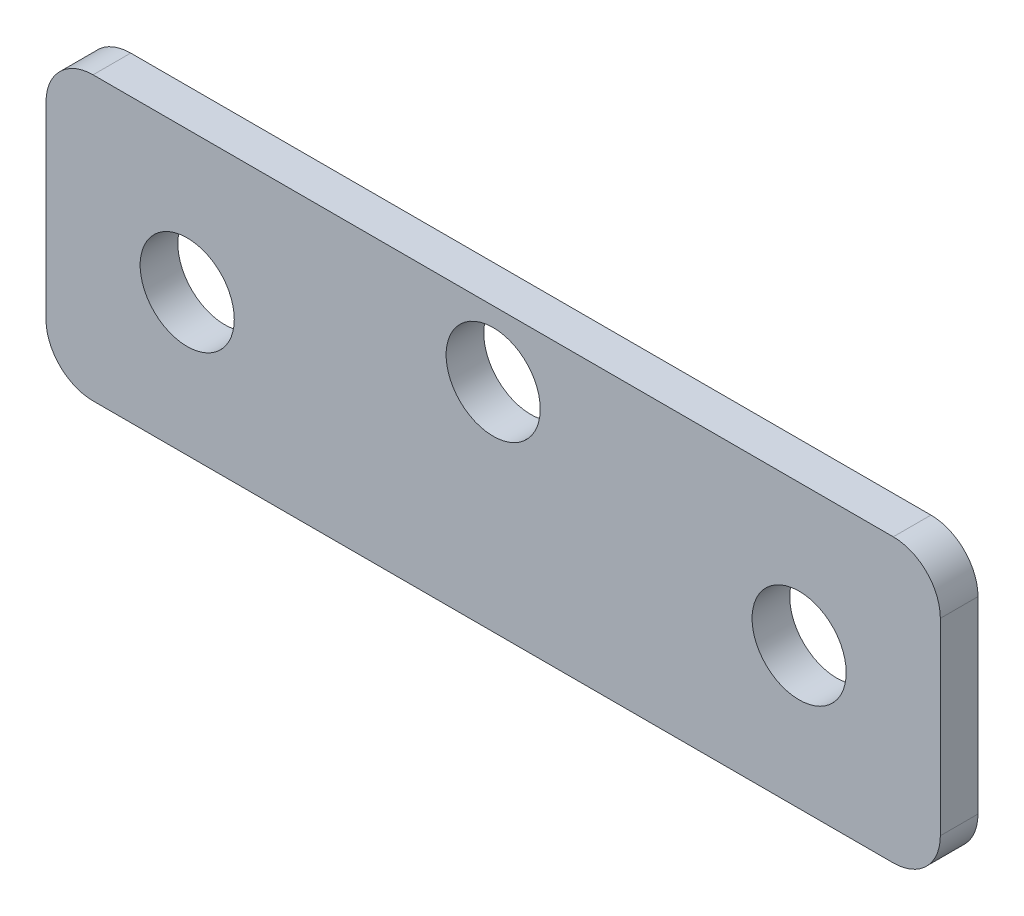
from build123d import *

# Parameters (mm, degrees)
ESQUISSE1_R          = 5
BASE_EXTRUSION_DEPTH = 4


with BuildPart() as part:
    # Esquisse1 → Base-Extrusion (new body)
    with BuildSketch(Plane.XY):
        with BuildLine():
            Line((-75, 15), (10, 15))
            ThreePointArc((10, 15), (13.535533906, 13.535533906), (15, 10))
            Line((15, 10), (15, -10))
            ThreePointArc((15, -10), (13.535533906, -13.535533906), (10, -15))
            Line((10, -15), (-75, -15))
            ThreePointArc((-75, -15), (-78.535533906, -13.535533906), (-80, -10))
            Line((-80, -10), (-80, 10))
            ThreePointArc((-80, 10), (-78.535533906, 13.535533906), (-75, 15))
        make_face()
        Circle(ESQUISSE1_R, mode=Mode.SUBTRACT)
        with Locations((-65, 0)):
            Circle(ESQUISSE1_R, mode=Mode.SUBTRACT)
        with Locations((-32.5, 8)):
            Circle(ESQUISSE1_R, mode=Mode.SUBTRACT)
    extrude(amount=BASE_EXTRUSION_DEPTH)


solid = part.part
